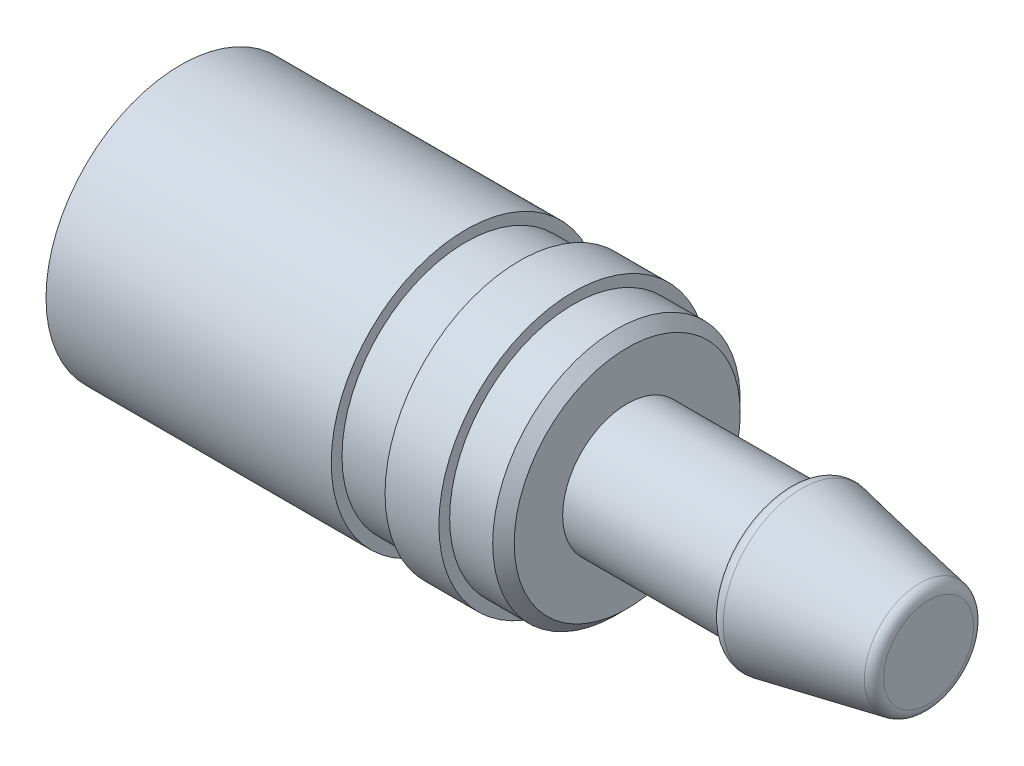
ISO-10303-21;
HEADER;
FILE_DESCRIPTION(('STEP AP214'),'2;1');
FILE_NAME('part.step','',(''),(''),'','','');
FILE_SCHEMA(('AUTOMOTIVE_DESIGN { 1 0 10303 214 1 1 1 1 }'));
ENDSEC;
DATA;
#1=APPLICATION_CONTEXT('core data for automotive mechanical design processes');
#2=APPLICATION_PROTOCOL_DEFINITION('international standard','automotive_design',2000,#1);
#3=PRODUCT_CONTEXT('',#1,'mechanical');
#4=PRODUCT('Part','Part','',(#3));
#5=PRODUCT_RELATED_PRODUCT_CATEGORY('part','',(#4));
#6=PRODUCT_DEFINITION_FORMATION('','',#4);
#7=PRODUCT_DEFINITION_CONTEXT('part definition',#1,'design');
#8=PRODUCT_DEFINITION('design','',#6,#7);
#9=PRODUCT_DEFINITION_SHAPE('','',#8);
#10=(LENGTH_UNIT() NAMED_UNIT(*) SI_UNIT(.MILLI.,.METRE.));
#11=(NAMED_UNIT(*) PLANE_ANGLE_UNIT() SI_UNIT($,.RADIAN.));
#12=(NAMED_UNIT(*) SI_UNIT($,.STERADIAN.) SOLID_ANGLE_UNIT());
#13=UNCERTAINTY_MEASURE_WITH_UNIT(LENGTH_MEASURE(1.E-05),#10,'distance_accuracy_value','');
#14=(GEOMETRIC_REPRESENTATION_CONTEXT(3) GLOBAL_UNCERTAINTY_ASSIGNED_CONTEXT((#13)) GLOBAL_UNIT_ASSIGNED_CONTEXT((#10,
#11,#12)) REPRESENTATION_CONTEXT('',''));
#15=CARTESIAN_POINT('',(0.,0.,0.));
#16=DIRECTION('',(0.,0.,1.));
#17=DIRECTION('',(1.,0.,0.));
#18=AXIS2_PLACEMENT_3D('',#15,#16,#17);
#19=CARTESIAN_POINT('',(69.5,0.,0.));
#20=DIRECTION('',(-1.,0.,0.));
#21=DIRECTION('',(0.,0.,1.));
#22=AXIS2_PLACEMENT_3D('',#19,#20,#21);
#23=PLANE('',#22);
#24=CARTESIAN_POINT('',(69.5,0.,0.));
#25=DIRECTION('',(-1.,0.,0.));
#26=DIRECTION('',(0.,0.,1.));
#27=AXIS2_PLACEMENT_3D('',#24,#25,#26);
#28=CIRCLE('',#27,4.17398443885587);
#29=CARTESIAN_POINT('',(69.5,0.,4.17398443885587));
#30=VERTEX_POINT('',#29);
#31=EDGE_CURVE('E46',#30,#30,#28,.F.);
#32=ORIENTED_EDGE('',*,*,#31,.T.);
#33=EDGE_LOOP('',(#32));
#34=FACE_BOUND('',#33,.T.);
#35=ADVANCED_FACE('F31',(#34),#23,.F.);
#36=CARTESIAN_POINT('',(69.5,0.,0.));
#37=DIRECTION('',(-1.,0.,0.));
#38=DIRECTION('',(0.,0.,1.));
#39=AXIS2_PLACEMENT_3D('',#36,#37,#38);
#40=CONICAL_SURFACE('',#39,5.,0.189988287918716);
#41=CARTESIAN_POINT('',(68.6888473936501,0.,0.));
#42=DIRECTION('',(1.,0.,0.));
#43=DIRECTION('',(0.,0.,-1.));
#44=AXIS2_PLACEMENT_3D('',#41,#42,#43);
#45=CIRCLE('',#44,5.15599088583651);
#46=CARTESIAN_POINT('',(68.6888473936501,0.,-5.15599088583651));
#47=VERTEX_POINT('',#46);
#48=EDGE_CURVE('E51',#47,#47,#45,.F.);
#49=ORIENTED_EDGE('',*,*,#48,.T.);
#50=EDGE_LOOP('',(#49));
#51=FACE_BOUND('',#50,.T.);
#52=CARTESIAN_POINT('',(57.6888473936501,0.,0.));
#53=DIRECTION('',(1.,0.,0.));
#54=DIRECTION('',(0.,0.,-1.));
#55=AXIS2_PLACEMENT_3D('',#52,#53,#54);
#56=CIRCLE('',#55,7.27137550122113);
#57=CARTESIAN_POINT('',(57.6888473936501,0.,-7.27137550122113));
#58=VERTEX_POINT('',#57);
#59=EDGE_CURVE('E54',#58,#58,#56,.T.);
#60=ORIENTED_EDGE('',*,*,#59,.T.);
#61=EDGE_LOOP('',(#60));
#62=FACE_BOUND('',#61,.T.);
#63=ADVANCED_FACE('F133',(#51,#62),#40,.T.);
#64=CARTESIAN_POINT('',(56.5,6.,0.));
#65=DIRECTION('',(1.,0.,0.));
#66=DIRECTION('',(0.,0.,-1.));
#67=AXIS2_PLACEMENT_3D('',#64,#65,#66);
#68=PLANE('',#67);
#69=CARTESIAN_POINT('',(56.5,0.,0.));
#70=DIRECTION('',(1.,0.,0.));
#71=DIRECTION('',(0.,0.,-1.));
#72=AXIS2_PLACEMENT_3D('',#69,#70,#71);
#73=CIRCLE('',#72,6.28936905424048);
#74=CARTESIAN_POINT('',(56.5,0.,-6.28936905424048));
#75=VERTEX_POINT('',#74);
#76=EDGE_CURVE('E42',#75,#75,#73,.F.);
#77=ORIENTED_EDGE('',*,*,#76,.T.);
#78=EDGE_LOOP('',(#77));
#79=FACE_BOUND('',#78,.T.);
#80=CARTESIAN_POINT('',(56.5,0.,0.));
#81=DIRECTION('',(-1.,0.,0.));
#82=DIRECTION('',(0.,0.,1.));
#83=AXIS2_PLACEMENT_3D('',#80,#81,#82);
#84=CIRCLE('',#83,6.);
#85=CARTESIAN_POINT('',(56.5,0.,6.));
#86=VERTEX_POINT('',#85);
#87=EDGE_CURVE('E57',#86,#86,#84,.T.);
#88=ORIENTED_EDGE('',*,*,#87,.F.);
#89=EDGE_LOOP('',(#88));
#90=FACE_BOUND('',#89,.T.);
#91=ADVANCED_FACE('F139',(#79,#90),#68,.F.);
#92=CARTESIAN_POINT('',(0.,0.,0.));
#93=DIRECTION('',(-1.,0.,0.));
#94=DIRECTION('',(0.,0.,1.));
#95=AXIS2_PLACEMENT_3D('',#92,#93,#94);
#96=CYLINDRICAL_SURFACE('',#95,6.);
#97=CARTESIAN_POINT('',(41.5,0.,0.));
#98=DIRECTION('',(-1.,0.,0.));
#99=DIRECTION('',(0.,0.,1.));
#100=AXIS2_PLACEMENT_3D('',#97,#98,#99);
#101=CIRCLE('',#100,6.);
#102=CARTESIAN_POINT('',(41.5,0.,6.));
#103=VERTEX_POINT('',#102);
#104=EDGE_CURVE('E60',#103,#103,#101,.T.);
#105=ORIENTED_EDGE('',*,*,#104,.F.);
#106=EDGE_LOOP('',(#105));
#107=FACE_BOUND('',#106,.T.);
#108=ORIENTED_EDGE('',*,*,#87,.T.);
#109=EDGE_LOOP('',(#108));
#110=FACE_BOUND('',#109,.T.);
#111=ADVANCED_FACE('F130',(#107,#110),#96,.T.);
#112=CARTESIAN_POINT('',(41.5,11.5,0.));
#113=DIRECTION('',(-1.,0.,0.));
#114=DIRECTION('',(0.,0.,1.));
#115=AXIS2_PLACEMENT_3D('',#112,#113,#114);
#116=PLANE('',#115);
#117=CARTESIAN_POINT('',(41.5,0.,0.));
#118=DIRECTION('',(-1.,0.,0.));
#119=DIRECTION('',(0.,0.,1.));
#120=AXIS2_PLACEMENT_3D('',#117,#118,#119);
#121=CIRCLE('',#120,10.5);
#122=CARTESIAN_POINT('',(41.5,0.,10.5));
#123=VERTEX_POINT('',#122);
#124=EDGE_CURVE('E10',#123,#123,#121,.F.);
#125=ORIENTED_EDGE('',*,*,#124,.T.);
#126=EDGE_LOOP('',(#125));
#127=FACE_BOUND('',#126,.T.);
#128=ORIENTED_EDGE('',*,*,#104,.T.);
#129=EDGE_LOOP('',(#128));
#130=FACE_BOUND('',#129,.T.);
#131=ADVANCED_FACE('F125',(#127,#130),#116,.F.);
#132=CARTESIAN_POINT('',(0.,0.,0.));
#133=DIRECTION('',(-1.,0.,0.));
#134=DIRECTION('',(0.,0.,1.));
#135=AXIS2_PLACEMENT_3D('',#132,#133,#134);
#136=CYLINDRICAL_SURFACE('',#135,11.5);
#137=CARTESIAN_POINT('',(40.5,0.,0.));
#138=DIRECTION('',(-1.,0.,0.));
#139=DIRECTION('',(0.,0.,1.));
#140=AXIS2_PLACEMENT_3D('',#137,#138,#139);
#141=CIRCLE('',#140,11.5);
#142=CARTESIAN_POINT('',(40.5,0.,11.5));
#143=VERTEX_POINT('',#142);
#144=EDGE_CURVE('E38',#143,#143,#141,.T.);
#145=ORIENTED_EDGE('',*,*,#144,.T.);
#146=EDGE_LOOP('',(#145));
#147=FACE_BOUND('',#146,.T.);
#148=CARTESIAN_POINT('',(36.5,0.,0.));
#149=DIRECTION('',(-1.,0.,0.));
#150=DIRECTION('',(0.,0.,1.));
#151=AXIS2_PLACEMENT_3D('',#148,#149,#150);
#152=CIRCLE('',#151,11.5);
#153=CARTESIAN_POINT('',(36.5,0.,11.5));
#154=VERTEX_POINT('',#153);
#155=EDGE_CURVE('E63',#154,#154,#152,.T.);
#156=ORIENTED_EDGE('',*,*,#155,.F.);
#157=EDGE_LOOP('',(#156));
#158=FACE_BOUND('',#157,.T.);
#159=ADVANCED_FACE('F120',(#147,#158),#136,.T.);
#160=CARTESIAN_POINT('',(36.5,12.5,0.));
#161=DIRECTION('',(-1.,0.,0.));
#162=DIRECTION('',(0.,0.,1.));
#163=AXIS2_PLACEMENT_3D('',#160,#161,#162);
#164=PLANE('',#163);
#165=CARTESIAN_POINT('',(36.5,0.,0.));
#166=DIRECTION('',(-1.,0.,0.));
#167=DIRECTION('',(0.,0.,1.));
#168=AXIS2_PLACEMENT_3D('',#165,#166,#167);
#169=CIRCLE('',#168,12.5);
#170=CARTESIAN_POINT('',(36.5,0.,12.5));
#171=VERTEX_POINT('',#170);
#172=EDGE_CURVE('E66',#171,#171,#169,.T.);
#173=ORIENTED_EDGE('',*,*,#172,.F.);
#174=EDGE_LOOP('',(#173));
#175=FACE_BOUND('',#174,.T.);
#176=ORIENTED_EDGE('',*,*,#155,.T.);
#177=EDGE_LOOP('',(#176));
#178=FACE_BOUND('',#177,.T.);
#179=ADVANCED_FACE('F114',(#175,#178),#164,.F.);
#180=CARTESIAN_POINT('',(0.,0.,0.));
#181=DIRECTION('',(-1.,0.,0.));
#182=DIRECTION('',(0.,0.,1.));
#183=AXIS2_PLACEMENT_3D('',#180,#181,#182);
#184=CYLINDRICAL_SURFACE('',#183,12.5);
#185=CARTESIAN_POINT('',(31.5,0.,0.));
#186=DIRECTION('',(-1.,0.,0.));
#187=DIRECTION('',(0.,0.,1.));
#188=AXIS2_PLACEMENT_3D('',#185,#186,#187);
#189=CIRCLE('',#188,12.5);
#190=CARTESIAN_POINT('',(31.5,0.,12.5));
#191=VERTEX_POINT('',#190);
#192=EDGE_CURVE('E69',#191,#191,#189,.T.);
#193=ORIENTED_EDGE('',*,*,#192,.F.);
#194=EDGE_LOOP('',(#193));
#195=FACE_BOUND('',#194,.T.);
#196=ORIENTED_EDGE('',*,*,#172,.T.);
#197=EDGE_LOOP('',(#196));
#198=FACE_BOUND('',#197,.T.);
#199=ADVANCED_FACE('F108',(#195,#198),#184,.T.);
#200=CARTESIAN_POINT('',(31.5,11.5,0.));
#201=DIRECTION('',(1.,0.,0.));
#202=DIRECTION('',(0.,0.,-1.));
#203=AXIS2_PLACEMENT_3D('',#200,#201,#202);
#204=PLANE('',#203);
#205=CARTESIAN_POINT('',(31.5,0.,0.));
#206=DIRECTION('',(-1.,0.,0.));
#207=DIRECTION('',(0.,0.,1.));
#208=AXIS2_PLACEMENT_3D('',#205,#206,#207);
#209=CIRCLE('',#208,11.5);
#210=CARTESIAN_POINT('',(31.5,0.,11.5));
#211=VERTEX_POINT('',#210);
#212=EDGE_CURVE('E72',#211,#211,#209,.T.);
#213=ORIENTED_EDGE('',*,*,#212,.F.);
#214=EDGE_LOOP('',(#213));
#215=FACE_BOUND('',#214,.T.);
#216=ORIENTED_EDGE('',*,*,#192,.T.);
#217=EDGE_LOOP('',(#216));
#218=FACE_BOUND('',#217,.T.);
#219=ADVANCED_FACE('F102',(#215,#218),#204,.F.);
#220=CARTESIAN_POINT('',(0.,0.,0.));
#221=DIRECTION('',(-1.,0.,0.));
#222=DIRECTION('',(0.,0.,1.));
#223=AXIS2_PLACEMENT_3D('',#220,#221,#222);
#224=CYLINDRICAL_SURFACE('',#223,11.5);
#225=CARTESIAN_POINT('',(26.5,0.,0.));
#226=DIRECTION('',(-1.,0.,0.));
#227=DIRECTION('',(0.,0.,1.));
#228=AXIS2_PLACEMENT_3D('',#225,#226,#227);
#229=CIRCLE('',#228,11.5);
#230=CARTESIAN_POINT('',(26.5,0.,11.5));
#231=VERTEX_POINT('',#230);
#232=EDGE_CURVE('E75',#231,#231,#229,.T.);
#233=ORIENTED_EDGE('',*,*,#232,.F.);
#234=EDGE_LOOP('',(#233));
#235=FACE_BOUND('',#234,.T.);
#236=ORIENTED_EDGE('',*,*,#212,.T.);
#237=EDGE_LOOP('',(#236));
#238=FACE_BOUND('',#237,.T.);
#239=ADVANCED_FACE('F96',(#235,#238),#224,.T.);
#240=CARTESIAN_POINT('',(26.5,12.5,0.));
#241=DIRECTION('',(-1.,0.,0.));
#242=DIRECTION('',(0.,0.,1.));
#243=AXIS2_PLACEMENT_3D('',#240,#241,#242);
#244=PLANE('',#243);
#245=CARTESIAN_POINT('',(26.5,0.,0.));
#246=DIRECTION('',(-1.,0.,0.));
#247=DIRECTION('',(0.,0.,1.));
#248=AXIS2_PLACEMENT_3D('',#245,#246,#247);
#249=CIRCLE('',#248,12.5);
#250=CARTESIAN_POINT('',(26.5,0.,12.5));
#251=VERTEX_POINT('',#250);
#252=EDGE_CURVE('E78',#251,#251,#249,.T.);
#253=ORIENTED_EDGE('',*,*,#252,.F.);
#254=EDGE_LOOP('',(#253));
#255=FACE_BOUND('',#254,.T.);
#256=ORIENTED_EDGE('',*,*,#232,.T.);
#257=EDGE_LOOP('',(#256));
#258=FACE_BOUND('',#257,.T.);
#259=ADVANCED_FACE('F90',(#255,#258),#244,.F.);
#260=CARTESIAN_POINT('',(0.,0.,0.));
#261=DIRECTION('',(-1.,0.,0.));
#262=DIRECTION('',(0.,0.,1.));
#263=AXIS2_PLACEMENT_3D('',#260,#261,#262);
#264=CYLINDRICAL_SURFACE('',#263,12.5);
#265=CARTESIAN_POINT('',(0.,0.,0.));
#266=DIRECTION('',(-1.,0.,0.));
#267=DIRECTION('',(0.,0.,1.));
#268=AXIS2_PLACEMENT_3D('',#265,#266,#267);
#269=CIRCLE('',#268,12.5);
#270=CARTESIAN_POINT('',(0.,0.,12.5));
#271=VERTEX_POINT('',#270);
#272=EDGE_CURVE('E81',#271,#271,#269,.T.);
#273=ORIENTED_EDGE('',*,*,#272,.F.);
#274=EDGE_LOOP('',(#273));
#275=FACE_BOUND('',#274,.T.);
#276=ORIENTED_EDGE('',*,*,#252,.T.);
#277=EDGE_LOOP('',(#276));
#278=FACE_BOUND('',#277,.T.);
#279=ADVANCED_FACE('F87',(#275,#278),#264,.T.);
#280=CARTESIAN_POINT('',(0.,0.,0.));
#281=DIRECTION('',(1.,0.,0.));
#282=DIRECTION('',(0.,0.,-1.));
#283=AXIS2_PLACEMENT_3D('',#280,#281,#282);
#284=PLANE('',#283);
#285=ORIENTED_EDGE('',*,*,#272,.T.);
#286=EDGE_LOOP('',(#285));
#287=FACE_BOUND('',#286,.T.);
#288=ADVANCED_FACE('F85',(#287),#284,.F.);
#289=CARTESIAN_POINT('',(68.5,0.,0.));
#290=DIRECTION('',(-1.,0.,0.));
#291=DIRECTION('',(0.,0.,1.));
#292=AXIS2_PLACEMENT_3D('',#289,#290,#291);
#293=TOROIDAL_SURFACE('',#292,4.17398443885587,1.);
#294=ORIENTED_EDGE('',*,*,#31,.F.);
#295=EDGE_LOOP('',(#294));
#296=FACE_BOUND('',#295,.T.);
#297=ORIENTED_EDGE('',*,*,#48,.F.);
#298=EDGE_LOOP('',(#297));
#299=FACE_BOUND('',#298,.T.);
#300=ADVANCED_FACE('F144',(#296,#299),#293,.T.);
#301=CARTESIAN_POINT('',(57.5,0.,0.));
#302=DIRECTION('',(1.,0.,0.));
#303=DIRECTION('',(0.,0.,-1.));
#304=AXIS2_PLACEMENT_3D('',#301,#302,#303);
#305=TOROIDAL_SURFACE('',#304,6.28936905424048,1.);
#306=ORIENTED_EDGE('',*,*,#59,.F.);
#307=EDGE_LOOP('',(#306));
#308=FACE_BOUND('',#307,.T.);
#309=ORIENTED_EDGE('',*,*,#76,.F.);
#310=EDGE_LOOP('',(#309));
#311=FACE_BOUND('',#310,.T.);
#312=ADVANCED_FACE('F146',(#308,#311),#305,.T.);
#313=CARTESIAN_POINT('',(40.5,0.,0.));
#314=DIRECTION('',(-1.,0.,0.));
#315=DIRECTION('',(0.,0.,1.));
#316=AXIS2_PLACEMENT_3D('',#313,#314,#315);
#317=CONICAL_SURFACE('',#316,11.5,0.785398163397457);
#318=ORIENTED_EDGE('',*,*,#124,.F.);
#319=EDGE_LOOP('',(#318));
#320=FACE_BOUND('',#319,.T.);
#321=ORIENTED_EDGE('',*,*,#144,.F.);
#322=EDGE_LOOP('',(#321));
#323=FACE_BOUND('',#322,.T.);
#324=ADVANCED_FACE('F33',(#320,#323),#317,.T.);
#325=CLOSED_SHELL('',(#35,#63,#91,#111,#131,#159,#179,#199,#219,#239,#259,#279,#288,#300,#312,#324));
#326=MANIFOLD_SOLID_BREP('B2',#325);
#327=ADVANCED_BREP_SHAPE_REPRESENTATION('',(#18,#326),#14);
#328=SHAPE_DEFINITION_REPRESENTATION(#9,#327);
ENDSEC;
END-ISO-10303-21;
